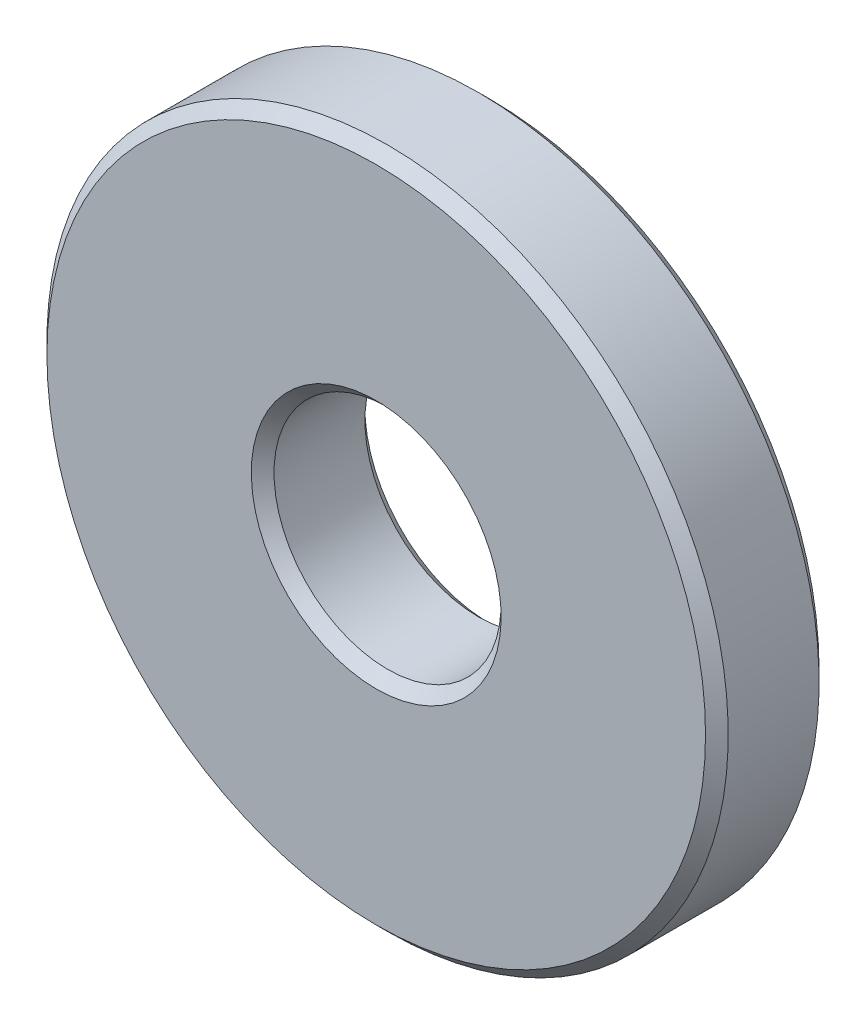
ISO-10303-21;
HEADER;
FILE_DESCRIPTION(('STEP AP214'),'2;1');
FILE_NAME('part.step','',(''),(''),'','','');
FILE_SCHEMA(('AUTOMOTIVE_DESIGN { 1 0 10303 214 1 1 1 1 }'));
ENDSEC;
DATA;
#1=APPLICATION_CONTEXT('core data for automotive mechanical design processes');
#2=APPLICATION_PROTOCOL_DEFINITION('international standard','automotive_design',2000,#1);
#3=PRODUCT_CONTEXT('',#1,'mechanical');
#4=PRODUCT('Part','Part','',(#3));
#5=PRODUCT_RELATED_PRODUCT_CATEGORY('part','',(#4));
#6=PRODUCT_DEFINITION_FORMATION('','',#4);
#7=PRODUCT_DEFINITION_CONTEXT('part definition',#1,'design');
#8=PRODUCT_DEFINITION('design','',#6,#7);
#9=PRODUCT_DEFINITION_SHAPE('','',#8);
#10=(LENGTH_UNIT() NAMED_UNIT(*) SI_UNIT(.MILLI.,.METRE.));
#11=(NAMED_UNIT(*) PLANE_ANGLE_UNIT() SI_UNIT($,.RADIAN.));
#12=(NAMED_UNIT(*) SI_UNIT($,.STERADIAN.) SOLID_ANGLE_UNIT());
#13=UNCERTAINTY_MEASURE_WITH_UNIT(LENGTH_MEASURE(1.E-05),#10,'distance_accuracy_value','');
#14=(GEOMETRIC_REPRESENTATION_CONTEXT(3) GLOBAL_UNCERTAINTY_ASSIGNED_CONTEXT((#13)) GLOBAL_UNIT_ASSIGNED_CONTEXT((#10,
#11,#12)) REPRESENTATION_CONTEXT('',''));
#15=CARTESIAN_POINT('',(0.,0.,0.));
#16=DIRECTION('',(0.,0.,1.));
#17=DIRECTION('',(1.,0.,0.));
#18=AXIS2_PLACEMENT_3D('',#15,#16,#17);
#19=CARTESIAN_POINT('',(0.,0.,0.));
#20=DIRECTION('',(0.,0.,-1.));
#21=DIRECTION('',(0.,1.,0.));
#22=AXIS2_PLACEMENT_3D('',#19,#20,#21);
#23=CYLINDRICAL_SURFACE('',#22,2.);
#24=CARTESIAN_POINT('',(0.,0.,0.2));
#25=DIRECTION('',(0.,0.,-1.));
#26=DIRECTION('',(0.,1.,0.));
#27=AXIS2_PLACEMENT_3D('',#24,#25,#26);
#28=CIRCLE('',#27,2.);
#29=CARTESIAN_POINT('',(0.,2.,0.2));
#30=VERTEX_POINT('',#29);
#31=EDGE_CURVE('E38',#30,#30,#28,.T.);
#32=ORIENTED_EDGE('',*,*,#31,.T.);
#33=EDGE_LOOP('',(#32));
#34=FACE_BOUND('',#33,.T.);
#35=CARTESIAN_POINT('',(0.,0.,1.8));
#36=DIRECTION('',(0.,0.,1.));
#37=DIRECTION('',(0.,-1.,0.));
#38=AXIS2_PLACEMENT_3D('',#35,#36,#37);
#39=CIRCLE('',#38,2.);
#40=CARTESIAN_POINT('',(0.,-2.,1.8));
#41=VERTEX_POINT('',#40);
#42=EDGE_CURVE('E41',#41,#41,#39,.T.);
#43=ORIENTED_EDGE('',*,*,#42,.T.);
#44=EDGE_LOOP('',(#43));
#45=FACE_BOUND('',#44,.T.);
#46=ADVANCED_FACE('F12',(#34,#45),#23,.F.);
#47=CARTESIAN_POINT('',(2.,0.,2.));
#48=DIRECTION('',(0.,0.,1.));
#49=DIRECTION('',(0.,-1.,0.));
#50=AXIS2_PLACEMENT_3D('',#47,#48,#49);
#51=PLANE('',#50);
#52=CARTESIAN_POINT('',(0.,0.,2.));
#53=DIRECTION('',(0.,0.,1.));
#54=DIRECTION('',(0.,-1.,0.));
#55=AXIS2_PLACEMENT_3D('',#52,#53,#54);
#56=CIRCLE('',#55,2.2);
#57=CARTESIAN_POINT('',(0.,-2.2,2.));
#58=VERTEX_POINT('',#57);
#59=EDGE_CURVE('E23',#58,#58,#56,.F.);
#60=ORIENTED_EDGE('',*,*,#59,.T.);
#61=EDGE_LOOP('',(#60));
#62=FACE_BOUND('',#61,.T.);
#63=CARTESIAN_POINT('',(0.,0.,2.));
#64=DIRECTION('',(0.,0.,1.));
#65=DIRECTION('',(0.,-1.,0.));
#66=AXIS2_PLACEMENT_3D('',#63,#64,#65);
#67=CIRCLE('',#66,5.8);
#68=CARTESIAN_POINT('',(0.,-5.8,2.));
#69=VERTEX_POINT('',#68);
#70=EDGE_CURVE('E27',#69,#69,#67,.T.);
#71=ORIENTED_EDGE('',*,*,#70,.T.);
#72=EDGE_LOOP('',(#71));
#73=FACE_BOUND('',#72,.T.);
#74=ADVANCED_FACE('F54',(#62,#73),#51,.T.);
#75=CARTESIAN_POINT('',(0.,0.,0.));
#76=DIRECTION('',(0.,0.,-1.));
#77=DIRECTION('',(0.,1.,0.));
#78=AXIS2_PLACEMENT_3D('',#75,#76,#77);
#79=CYLINDRICAL_SURFACE('',#78,6.);
#80=CARTESIAN_POINT('',(0.,0.,0.2));
#81=DIRECTION('',(0.,0.,-1.));
#82=DIRECTION('',(0.,1.,0.));
#83=AXIS2_PLACEMENT_3D('',#80,#81,#82);
#84=CIRCLE('',#83,6.);
#85=CARTESIAN_POINT('',(0.,6.,0.2));
#86=VERTEX_POINT('',#85);
#87=EDGE_CURVE('E8',#86,#86,#84,.F.);
#88=ORIENTED_EDGE('',*,*,#87,.T.);
#89=EDGE_LOOP('',(#88));
#90=FACE_BOUND('',#89,.T.);
#91=CARTESIAN_POINT('',(0.,0.,1.8));
#92=DIRECTION('',(0.,0.,1.));
#93=DIRECTION('',(0.,-1.,0.));
#94=AXIS2_PLACEMENT_3D('',#91,#92,#93);
#95=CIRCLE('',#94,6.);
#96=CARTESIAN_POINT('',(0.,-6.,1.8));
#97=VERTEX_POINT('',#96);
#98=EDGE_CURVE('E19',#97,#97,#95,.F.);
#99=ORIENTED_EDGE('',*,*,#98,.T.);
#100=EDGE_LOOP('',(#99));
#101=FACE_BOUND('',#100,.T.);
#102=ADVANCED_FACE('F57',(#90,#101),#79,.T.);
#103=CARTESIAN_POINT('',(2.,0.,0.));
#104=DIRECTION('',(0.,0.,-1.));
#105=DIRECTION('',(0.,1.,0.));
#106=AXIS2_PLACEMENT_3D('',#103,#104,#105);
#107=PLANE('',#106);
#108=CARTESIAN_POINT('',(0.,0.,0.));
#109=DIRECTION('',(0.,0.,-1.));
#110=DIRECTION('',(0.,1.,0.));
#111=AXIS2_PLACEMENT_3D('',#108,#109,#110);
#112=CIRCLE('',#111,2.2);
#113=CARTESIAN_POINT('',(0.,2.2,0.));
#114=VERTEX_POINT('',#113);
#115=EDGE_CURVE('E32',#114,#114,#112,.F.);
#116=ORIENTED_EDGE('',*,*,#115,.T.);
#117=EDGE_LOOP('',(#116));
#118=FACE_BOUND('',#117,.T.);
#119=CARTESIAN_POINT('',(0.,0.,0.));
#120=DIRECTION('',(0.,0.,-1.));
#121=DIRECTION('',(0.,1.,0.));
#122=AXIS2_PLACEMENT_3D('',#119,#120,#121);
#123=CIRCLE('',#122,5.8);
#124=CARTESIAN_POINT('',(0.,5.8,0.));
#125=VERTEX_POINT('',#124);
#126=EDGE_CURVE('E35',#125,#125,#123,.T.);
#127=ORIENTED_EDGE('',*,*,#126,.T.);
#128=EDGE_LOOP('',(#127));
#129=FACE_BOUND('',#128,.T.);
#130=ADVANCED_FACE('F78',(#118,#129),#107,.T.);
#131=CARTESIAN_POINT('',(0.,0.,0.2));
#132=DIRECTION('',(0.,0.,-1.));
#133=DIRECTION('',(0.,1.,0.));
#134=AXIS2_PLACEMENT_3D('',#131,#132,#133);
#135=CONICAL_SURFACE('',#134,2.,0.785398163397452);
#136=ORIENTED_EDGE('',*,*,#115,.F.);
#137=EDGE_LOOP('',(#136));
#138=FACE_BOUND('',#137,.T.);
#139=ORIENTED_EDGE('',*,*,#31,.F.);
#140=EDGE_LOOP('',(#139));
#141=FACE_BOUND('',#140,.T.);
#142=ADVANCED_FACE('F50',(#138,#141),#135,.F.);
#143=CARTESIAN_POINT('',(0.,0.,2.));
#144=DIRECTION('',(0.,0.,1.));
#145=DIRECTION('',(0.,-1.,0.));
#146=AXIS2_PLACEMENT_3D('',#143,#144,#145);
#147=CONICAL_SURFACE('',#146,2.2,0.785398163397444);
#148=ORIENTED_EDGE('',*,*,#42,.F.);
#149=EDGE_LOOP('',(#148));
#150=FACE_BOUND('',#149,.T.);
#151=ORIENTED_EDGE('',*,*,#59,.F.);
#152=EDGE_LOOP('',(#151));
#153=FACE_BOUND('',#152,.T.);
#154=ADVANCED_FACE('F46',(#150,#153),#147,.F.);
#155=CARTESIAN_POINT('',(0.,0.,0.));
#156=DIRECTION('',(0.,0.,1.));
#157=DIRECTION('',(0.,-1.,0.));
#158=AXIS2_PLACEMENT_3D('',#155,#156,#157);
#159=CONICAL_SURFACE('',#158,5.8,0.785398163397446);
#160=ORIENTED_EDGE('',*,*,#87,.F.);
#161=EDGE_LOOP('',(#160));
#162=FACE_BOUND('',#161,.T.);
#163=ORIENTED_EDGE('',*,*,#126,.F.);
#164=EDGE_LOOP('',(#163));
#165=FACE_BOUND('',#164,.T.);
#166=ADVANCED_FACE('F49',(#162,#165),#159,.T.);
#167=CARTESIAN_POINT('',(0.,0.,1.8));
#168=DIRECTION('',(0.,0.,-1.));
#169=DIRECTION('',(0.,1.,0.));
#170=AXIS2_PLACEMENT_3D('',#167,#168,#169);
#171=CONICAL_SURFACE('',#170,6.,0.785398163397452);
#172=ORIENTED_EDGE('',*,*,#70,.F.);
#173=EDGE_LOOP('',(#172));
#174=FACE_BOUND('',#173,.T.);
#175=ORIENTED_EDGE('',*,*,#98,.F.);
#176=EDGE_LOOP('',(#175));
#177=FACE_BOUND('',#176,.T.);
#178=ADVANCED_FACE('F14',(#174,#177),#171,.T.);
#179=CLOSED_SHELL('',(#46,#74,#102,#130,#142,#154,#166,#178));
#180=MANIFOLD_SOLID_BREP('B1',#179);
#181=ADVANCED_BREP_SHAPE_REPRESENTATION('',(#18,#180),#14);
#182=SHAPE_DEFINITION_REPRESENTATION(#9,#181);
ENDSEC;
END-ISO-10303-21;
